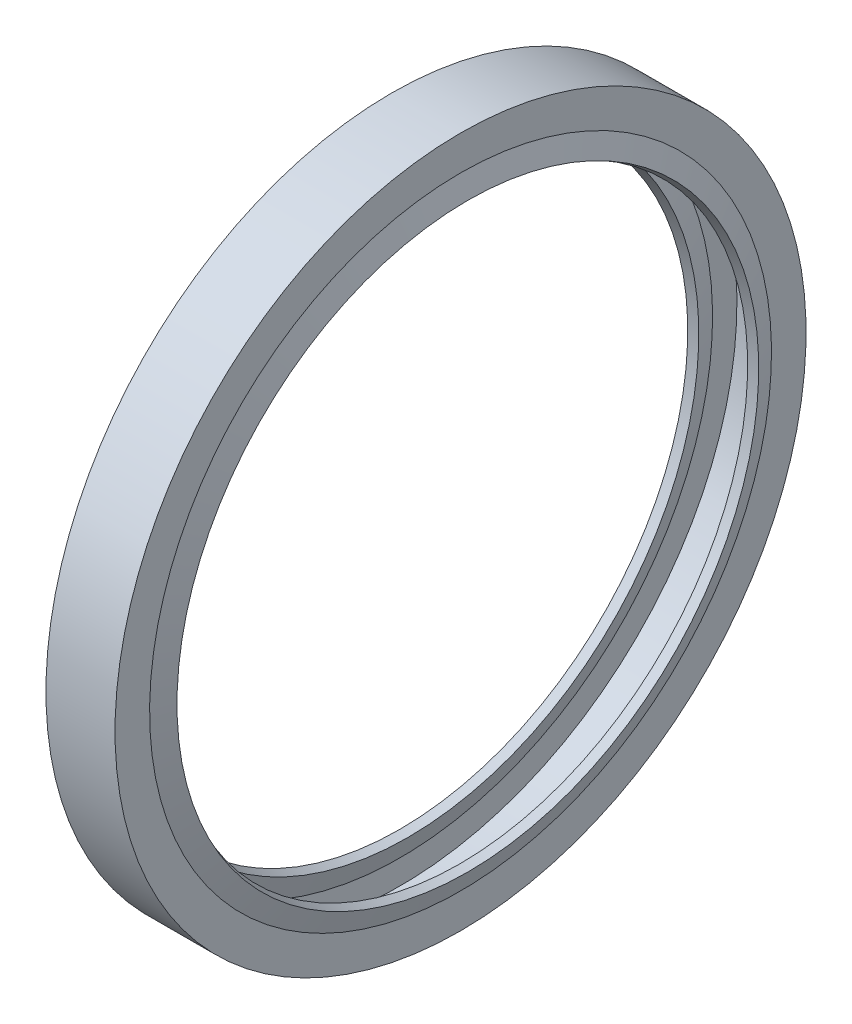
from build123d import *


with BuildPart() as part:
    # Esquisse1 → R_volution1 (revolve)
    with BuildSketch(Plane.XY):
        Polygon((-20.824578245, 60), (-20.824578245, 54), (-19.368697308, 50), (-17.959158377, 50.513030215), (-19.324578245, 54.264490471), (-19.324578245, 58.5), (-10.324578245, 58.5), (-10.324578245, 53.735509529), (-8.964963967, 50), (-7.555425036, 50.513030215), (-8.824578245, 54), (-8.824578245, 60), align=None)
    revolve(axis=Axis((0, 0, 0), (-1, 0, 0)))


solid = part.part
